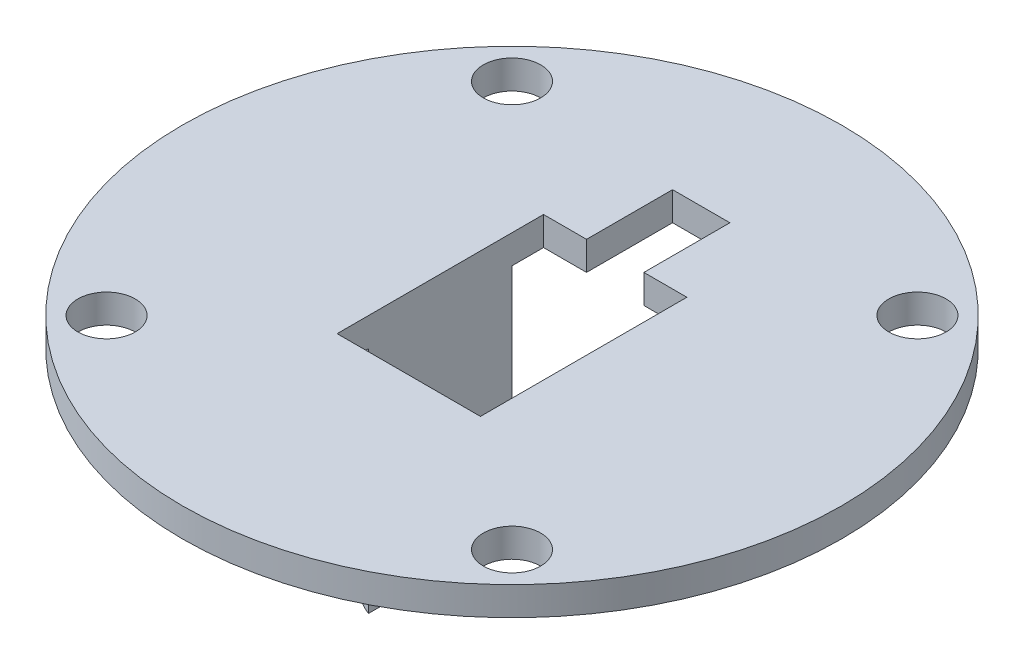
ISO-10303-21;
HEADER;
FILE_DESCRIPTION(('STEP AP214'),'2;1');
FILE_NAME('part.step','',(''),(''),'','','');
FILE_SCHEMA(('AUTOMOTIVE_DESIGN { 1 0 10303 214 1 1 1 1 }'));
ENDSEC;
DATA;
#1=APPLICATION_CONTEXT('core data for automotive mechanical design processes');
#2=APPLICATION_PROTOCOL_DEFINITION('international standard','automotive_design',2000,#1);
#3=PRODUCT_CONTEXT('',#1,'mechanical');
#4=PRODUCT('Part','Part','',(#3));
#5=PRODUCT_RELATED_PRODUCT_CATEGORY('part','',(#4));
#6=PRODUCT_DEFINITION_FORMATION('','',#4);
#7=PRODUCT_DEFINITION_CONTEXT('part definition',#1,'design');
#8=PRODUCT_DEFINITION('design','',#6,#7);
#9=PRODUCT_DEFINITION_SHAPE('','',#8);
#10=(LENGTH_UNIT() NAMED_UNIT(*) SI_UNIT(.MILLI.,.METRE.));
#11=(NAMED_UNIT(*) PLANE_ANGLE_UNIT() SI_UNIT($,.RADIAN.));
#12=(NAMED_UNIT(*) SI_UNIT($,.STERADIAN.) SOLID_ANGLE_UNIT());
#13=UNCERTAINTY_MEASURE_WITH_UNIT(LENGTH_MEASURE(1.E-05),#10,'distance_accuracy_value','');
#14=(GEOMETRIC_REPRESENTATION_CONTEXT(3) GLOBAL_UNCERTAINTY_ASSIGNED_CONTEXT((#13)) GLOBAL_UNIT_ASSIGNED_CONTEXT((#10,
#11,#12)) REPRESENTATION_CONTEXT('',''));
#15=CARTESIAN_POINT('',(0.,0.,0.));
#16=DIRECTION('',(0.,0.,1.));
#17=DIRECTION('',(1.,0.,0.));
#18=AXIS2_PLACEMENT_3D('',#15,#16,#17);
#19=CARTESIAN_POINT('',(-12.5,0.,-18.));
#20=DIRECTION('',(0.,0.,-1.));
#21=DIRECTION('',(-1.,0.,0.));
#22=AXIS2_PLACEMENT_3D('',#19,#20,#21);
#23=PLANE('',#22);
#24=DIRECTION('',(-1.,0.,0.));
#25=VECTOR('',#24,1.);
#26=CARTESIAN_POINT('',(-12.5,5.,-18.));
#27=LINE('',#26,#25);
#28=CARTESIAN_POINT('',(12.5,5.,-18.));
#29=VERTEX_POINT('',#28);
#30=CARTESIAN_POINT('',(5.,5.,-18.));
#31=VERTEX_POINT('',#30);
#32=EDGE_CURVE('E215',#29,#31,#27,.T.);
#33=ORIENTED_EDGE('',*,*,#32,.T.);
#34=DIRECTION('',(0.,-1.,0.));
#35=VECTOR('',#34,1.);
#36=CARTESIAN_POINT('',(5.,0.,-18.));
#37=LINE('',#36,#35);
#38=CARTESIAN_POINT('',(5.,0.,-18.));
#39=VERTEX_POINT('',#38);
#40=EDGE_CURVE('E11',#31,#39,#37,.T.);
#41=ORIENTED_EDGE('',*,*,#40,.T.);
#42=DIRECTION('',(-1.,0.,0.));
#43=VECTOR('',#42,1.);
#44=CARTESIAN_POINT('',(-12.5,0.,-18.));
#45=LINE('',#44,#43);
#46=CARTESIAN_POINT('',(12.5,0.,-18.));
#47=VERTEX_POINT('',#46);
#48=EDGE_CURVE('E199',#47,#39,#45,.T.);
#49=ORIENTED_EDGE('',*,*,#48,.F.);
#50=DIRECTION('',(0.,1.,0.));
#51=VECTOR('',#50,1.);
#52=CARTESIAN_POINT('',(12.5,0.,-18.));
#53=LINE('',#52,#51);
#54=EDGE_CURVE('E211',#47,#29,#53,.T.);
#55=ORIENTED_EDGE('',*,*,#54,.T.);
#56=EDGE_LOOP('',(#33,#41,#49,#55));
#57=FACE_BOUND('',#56,.T.);
#58=ADVANCED_FACE('F44',(#57),#23,.F.);
#59=CARTESIAN_POINT('',(0.,0.,0.));
#60=DIRECTION('',(0.,1.,0.));
#61=DIRECTION('',(0.,0.,1.));
#62=AXIS2_PLACEMENT_3D('',#59,#60,#61);
#63=PLANE('',#62);
#64=ORIENTED_EDGE('',*,*,#48,.T.);
#65=DIRECTION('',(0.,0.,-1.));
#66=VECTOR('',#65,1.);
#67=CARTESIAN_POINT('',(5.,0.,0.));
#68=LINE('',#67,#66);
#69=CARTESIAN_POINT('',(5.,0.,-33.));
#70=VERTEX_POINT('',#69);
#71=EDGE_CURVE('E170',#39,#70,#68,.T.);
#72=ORIENTED_EDGE('',*,*,#71,.T.);
#73=DIRECTION('',(-1.,0.,0.));
#74=VECTOR('',#73,1.);
#75=CARTESIAN_POINT('',(0.,0.,-33.));
#76=LINE('',#75,#74);
#77=CARTESIAN_POINT('',(-5.,0.,-33.));
#78=VERTEX_POINT('',#77);
#79=EDGE_CURVE('E142',#70,#78,#76,.T.);
#80=ORIENTED_EDGE('',*,*,#79,.T.);
#81=DIRECTION('',(0.,0.,1.));
#82=VECTOR('',#81,1.);
#83=CARTESIAN_POINT('',(-5.,0.,0.));
#84=LINE('',#83,#82);
#85=CARTESIAN_POINT('',(-5.,0.,-18.));
#86=VERTEX_POINT('',#85);
#87=EDGE_CURVE('E165',#78,#86,#84,.T.);
#88=ORIENTED_EDGE('',*,*,#87,.T.);
#89=CARTESIAN_POINT('',(-12.5,0.,-18.));
#90=VERTEX_POINT('',#89);
#91=EDGE_CURVE('E197',#86,#90,#45,.T.);
#92=ORIENTED_EDGE('',*,*,#91,.T.);
#93=DIRECTION('',(0.,0.,1.));
#94=VECTOR('',#93,1.);
#95=CARTESIAN_POINT('',(-12.5,0.,18.));
#96=LINE('',#95,#94);
#97=CARTESIAN_POINT('',(-12.5,0.,-12.5));
#98=VERTEX_POINT('',#97);
#99=EDGE_CURVE('E204',#90,#98,#96,.T.);
#100=ORIENTED_EDGE('',*,*,#99,.T.);
#101=CARTESIAN_POINT('',(-11.5,0.,-6.58392021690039));
#102=DIRECTION('',(0.,1.,0.));
#103=DIRECTION('',(0.,0.,1.));
#104=AXIS2_PLACEMENT_3D('',#101,#102,#103);
#105=CIRCLE('',#104,6.);
#106=CARTESIAN_POINT('',(-17.5,0.,-6.58392021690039));
#107=VERTEX_POINT('',#106);
#108=EDGE_CURVE('E286',#98,#107,#105,.T.);
#109=ORIENTED_EDGE('',*,*,#108,.T.);
#110=DIRECTION('',(0.,0.,-1.));
#111=VECTOR('',#110,1.);
#112=CARTESIAN_POINT('',(-17.5,0.,-12.5));
#113=LINE('',#112,#111);
#114=CARTESIAN_POINT('',(-17.5,0.,6.58392021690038));
#115=VERTEX_POINT('',#114);
#116=EDGE_CURVE('E181',#115,#107,#113,.T.);
#117=ORIENTED_EDGE('',*,*,#116,.F.);
#118=CARTESIAN_POINT('',(-11.5,0.,6.58392021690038));
#119=DIRECTION('',(0.,1.,0.));
#120=DIRECTION('',(0.,0.,1.));
#121=AXIS2_PLACEMENT_3D('',#118,#119,#120);
#122=CIRCLE('',#121,6.);
#123=CARTESIAN_POINT('',(-12.5,0.,12.5));
#124=VERTEX_POINT('',#123);
#125=EDGE_CURVE('E289',#115,#124,#122,.T.);
#126=ORIENTED_EDGE('',*,*,#125,.T.);
#127=CARTESIAN_POINT('',(-12.5,0.,18.));
#128=VERTEX_POINT('',#127);
#129=EDGE_CURVE('E203',#124,#128,#96,.T.);
#130=ORIENTED_EDGE('',*,*,#129,.T.);
#131=DIRECTION('',(1.,0.,0.));
#132=VECTOR('',#131,1.);
#133=CARTESIAN_POINT('',(-12.5,0.,18.));
#134=LINE('',#133,#132);
#135=CARTESIAN_POINT('',(12.5,0.,18.));
#136=VERTEX_POINT('',#135);
#137=EDGE_CURVE('E207',#128,#136,#134,.T.);
#138=ORIENTED_EDGE('',*,*,#137,.T.);
#139=DIRECTION('',(0.,0.,-1.));
#140=VECTOR('',#139,1.);
#141=CARTESIAN_POINT('',(12.5,0.,18.));
#142=LINE('',#141,#140);
#143=EDGE_CURVE('E193',#136,#47,#142,.T.);
#144=ORIENTED_EDGE('',*,*,#143,.T.);
#145=EDGE_LOOP('',(#64,#72,#80,#88,#92,#100,#109,#117,#126,#130,#138,#144));
#146=FACE_BOUND('',#145,.T.);
#147=CARTESIAN_POINT('',(0.,0.,0.));
#148=DIRECTION('',(0.,1.,0.));
#149=DIRECTION('',(0.,0.,1.));
#150=AXIS2_PLACEMENT_3D('',#147,#148,#149);
#151=CIRCLE('',#150,57.5);
#152=CARTESIAN_POINT('',(0.,0.,57.5));
#153=VERTEX_POINT('',#152);
#154=EDGE_CURVE('E267',#153,#153,#151,.T.);
#155=ORIENTED_EDGE('',*,*,#154,.F.);
#156=EDGE_LOOP('',(#155));
#157=FACE_BOUND('',#156,.T.);
#158=CARTESIAN_POINT('',(-35.3553390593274,0.,-35.3553390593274));
#159=DIRECTION('',(0.,1.,0.));
#160=DIRECTION('',(0.,0.,1.));
#161=AXIS2_PLACEMENT_3D('',#158,#159,#160);
#162=CIRCLE('',#161,5.);
#163=CARTESIAN_POINT('',(-35.3553390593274,0.,-30.3553390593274));
#164=VERTEX_POINT('',#163);
#165=EDGE_CURVE('E263',#164,#164,#162,.T.);
#166=ORIENTED_EDGE('',*,*,#165,.T.);
#167=EDGE_LOOP('',(#166));
#168=FACE_BOUND('',#167,.T.);
#169=CARTESIAN_POINT('',(35.3553390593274,0.,-35.3553390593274));
#170=DIRECTION('',(0.,1.,0.));
#171=DIRECTION('',(0.,0.,1.));
#172=AXIS2_PLACEMENT_3D('',#169,#170,#171);
#173=CIRCLE('',#172,5.);
#174=CARTESIAN_POINT('',(35.3553390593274,0.,-30.3553390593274));
#175=VERTEX_POINT('',#174);
#176=EDGE_CURVE('E244',#175,#175,#173,.T.);
#177=ORIENTED_EDGE('',*,*,#176,.T.);
#178=EDGE_LOOP('',(#177));
#179=FACE_BOUND('',#178,.T.);
#180=CARTESIAN_POINT('',(35.3553390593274,0.,35.3553390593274));
#181=DIRECTION('',(0.,1.,0.));
#182=DIRECTION('',(0.,0.,1.));
#183=AXIS2_PLACEMENT_3D('',#180,#181,#182);
#184=CIRCLE('',#183,5.);
#185=CARTESIAN_POINT('',(35.3553390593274,0.,40.3553390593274));
#186=VERTEX_POINT('',#185);
#187=EDGE_CURVE('E252',#186,#186,#184,.T.);
#188=ORIENTED_EDGE('',*,*,#187,.T.);
#189=EDGE_LOOP('',(#188));
#190=FACE_BOUND('',#189,.T.);
#191=CARTESIAN_POINT('',(-35.3553390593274,0.,35.3553390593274));
#192=DIRECTION('',(0.,1.,0.));
#193=DIRECTION('',(0.,0.,1.));
#194=AXIS2_PLACEMENT_3D('',#191,#192,#193);
#195=CIRCLE('',#194,5.);
#196=CARTESIAN_POINT('',(-35.3553390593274,0.,40.3553390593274));
#197=VERTEX_POINT('',#196);
#198=EDGE_CURVE('E228',#197,#197,#195,.T.);
#199=ORIENTED_EDGE('',*,*,#198,.T.);
#200=EDGE_LOOP('',(#199));
#201=FACE_BOUND('',#200,.T.);
#202=ADVANCED_FACE('F309',(#146,#157,#168,#179,#190,#201),#63,.F.);
#203=CARTESIAN_POINT('',(0.,5.,0.));
#204=DIRECTION('',(0.,-1.,0.));
#205=DIRECTION('',(0.,0.,-1.));
#206=AXIS2_PLACEMENT_3D('',#203,#204,#205);
#207=CYLINDRICAL_SURFACE('',#206,57.5);
#208=CARTESIAN_POINT('',(0.,5.,0.));
#209=DIRECTION('',(0.,1.,0.));
#210=DIRECTION('',(0.,0.,1.));
#211=AXIS2_PLACEMENT_3D('',#208,#209,#210);
#212=CIRCLE('',#211,57.5);
#213=CARTESIAN_POINT('',(0.,5.,57.5));
#214=VERTEX_POINT('',#213);
#215=EDGE_CURVE('E271',#214,#214,#212,.T.);
#216=ORIENTED_EDGE('',*,*,#215,.F.);
#217=EDGE_LOOP('',(#216));
#218=FACE_BOUND('',#217,.T.);
#219=ORIENTED_EDGE('',*,*,#154,.T.);
#220=EDGE_LOOP('',(#219));
#221=FACE_BOUND('',#220,.T.);
#222=ADVANCED_FACE('F330',(#218,#221),#207,.T.);
#223=CARTESIAN_POINT('',(0.,5.,0.));
#224=DIRECTION('',(0.,1.,0.));
#225=DIRECTION('',(0.,0.,1.));
#226=AXIS2_PLACEMENT_3D('',#223,#224,#225);
#227=PLANE('',#226);
#228=DIRECTION('',(0.,0.,-1.));
#229=VECTOR('',#228,1.);
#230=CARTESIAN_POINT('',(5.,5.,-18.));
#231=LINE('',#230,#229);
#232=CARTESIAN_POINT('',(5.,5.,-33.));
#233=VERTEX_POINT('',#232);
#234=EDGE_CURVE('E149',#31,#233,#231,.T.);
#235=ORIENTED_EDGE('',*,*,#234,.F.);
#236=ORIENTED_EDGE('',*,*,#32,.F.);
#237=DIRECTION('',(0.,0.,-1.));
#238=VECTOR('',#237,1.);
#239=CARTESIAN_POINT('',(12.5,5.,18.));
#240=LINE('',#239,#238);
#241=CARTESIAN_POINT('',(12.5,5.,18.));
#242=VERTEX_POINT('',#241);
#243=EDGE_CURVE('E192',#242,#29,#240,.T.);
#244=ORIENTED_EDGE('',*,*,#243,.F.);
#245=DIRECTION('',(1.,0.,0.));
#246=VECTOR('',#245,1.);
#247=CARTESIAN_POINT('',(-12.5,5.,18.));
#248=LINE('',#247,#246);
#249=CARTESIAN_POINT('',(-12.5,5.,18.));
#250=VERTEX_POINT('',#249);
#251=EDGE_CURVE('E198',#250,#242,#248,.T.);
#252=ORIENTED_EDGE('',*,*,#251,.F.);
#253=DIRECTION('',(0.,0.,1.));
#254=VECTOR('',#253,1.);
#255=CARTESIAN_POINT('',(-12.5,5.,18.));
#256=LINE('',#255,#254);
#257=CARTESIAN_POINT('',(-12.5,5.,-18.));
#258=VERTEX_POINT('',#257);
#259=EDGE_CURVE('E218',#258,#250,#256,.T.);
#260=ORIENTED_EDGE('',*,*,#259,.F.);
#261=CARTESIAN_POINT('',(-5.,5.,-18.));
#262=VERTEX_POINT('',#261);
#263=EDGE_CURVE('E214',#262,#258,#27,.T.);
#264=ORIENTED_EDGE('',*,*,#263,.F.);
#265=DIRECTION('',(0.,0.,1.));
#266=VECTOR('',#265,1.);
#267=CARTESIAN_POINT('',(-5.,5.,-18.));
#268=LINE('',#267,#266);
#269=CARTESIAN_POINT('',(-5.,5.,-33.));
#270=VERTEX_POINT('',#269);
#271=EDGE_CURVE('E60',#270,#262,#268,.T.);
#272=ORIENTED_EDGE('',*,*,#271,.F.);
#273=DIRECTION('',(-1.,0.,0.));
#274=VECTOR('',#273,1.);
#275=CARTESIAN_POINT('',(-5.,5.,-33.));
#276=LINE('',#275,#274);
#277=EDGE_CURVE('E140',#233,#270,#276,.T.);
#278=ORIENTED_EDGE('',*,*,#277,.F.);
#279=EDGE_LOOP('',(#235,#236,#244,#252,#260,#264,#272,#278));
#280=FACE_BOUND('',#279,.T.);
#281=CARTESIAN_POINT('',(-35.3553390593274,5.,35.3553390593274));
#282=DIRECTION('',(0.,1.,0.));
#283=DIRECTION('',(0.,0.,1.));
#284=AXIS2_PLACEMENT_3D('',#281,#282,#283);
#285=CIRCLE('',#284,5.);
#286=CARTESIAN_POINT('',(-35.3553390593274,5.,40.3553390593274));
#287=VERTEX_POINT('',#286);
#288=EDGE_CURVE('E256',#287,#287,#285,.T.);
#289=ORIENTED_EDGE('',*,*,#288,.F.);
#290=EDGE_LOOP('',(#289));
#291=FACE_BOUND('',#290,.T.);
#292=CARTESIAN_POINT('',(35.3553390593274,5.,35.3553390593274));
#293=DIRECTION('',(0.,1.,0.));
#294=DIRECTION('',(0.,0.,1.));
#295=AXIS2_PLACEMENT_3D('',#292,#293,#294);
#296=CIRCLE('',#295,5.);
#297=CARTESIAN_POINT('',(35.3553390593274,5.,40.3553390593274));
#298=VERTEX_POINT('',#297);
#299=EDGE_CURVE('E248',#298,#298,#296,.T.);
#300=ORIENTED_EDGE('',*,*,#299,.F.);
#301=EDGE_LOOP('',(#300));
#302=FACE_BOUND('',#301,.T.);
#303=CARTESIAN_POINT('',(35.3553390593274,5.,-35.3553390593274));
#304=DIRECTION('',(0.,1.,0.));
#305=DIRECTION('',(0.,0.,1.));
#306=AXIS2_PLACEMENT_3D('',#303,#304,#305);
#307=CIRCLE('',#306,5.);
#308=CARTESIAN_POINT('',(35.3553390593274,5.,-30.3553390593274));
#309=VERTEX_POINT('',#308);
#310=EDGE_CURVE('E239',#309,#309,#307,.T.);
#311=ORIENTED_EDGE('',*,*,#310,.F.);
#312=EDGE_LOOP('',(#311));
#313=FACE_BOUND('',#312,.T.);
#314=CARTESIAN_POINT('',(-35.3553390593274,5.,-35.3553390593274));
#315=DIRECTION('',(0.,1.,0.));
#316=DIRECTION('',(0.,0.,1.));
#317=AXIS2_PLACEMENT_3D('',#314,#315,#316);
#318=CIRCLE('',#317,5.);
#319=CARTESIAN_POINT('',(-35.3553390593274,5.,-30.3553390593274));
#320=VERTEX_POINT('',#319);
#321=EDGE_CURVE('E243',#320,#320,#318,.T.);
#322=ORIENTED_EDGE('',*,*,#321,.F.);
#323=EDGE_LOOP('',(#322));
#324=FACE_BOUND('',#323,.T.);
#325=ORIENTED_EDGE('',*,*,#215,.T.);
#326=EDGE_LOOP('',(#325));
#327=FACE_BOUND('',#326,.T.);
#328=ADVANCED_FACE('F156',(#280,#291,#302,#313,#324,#327),#227,.T.);
#329=CARTESIAN_POINT('',(-35.3553390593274,0.,-35.3553390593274));
#330=DIRECTION('',(0.,1.,0.));
#331=DIRECTION('',(0.,0.,1.));
#332=AXIS2_PLACEMENT_3D('',#329,#330,#331);
#333=CYLINDRICAL_SURFACE('',#332,5.);
#334=ORIENTED_EDGE('',*,*,#165,.F.);
#335=EDGE_LOOP('',(#334));
#336=FACE_BOUND('',#335,.T.);
#337=ORIENTED_EDGE('',*,*,#321,.T.);
#338=EDGE_LOOP('',(#337));
#339=FACE_BOUND('',#338,.T.);
#340=ADVANCED_FACE('F376',(#336,#339),#333,.F.);
#341=CARTESIAN_POINT('',(35.3553390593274,0.,-35.3553390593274));
#342=DIRECTION('',(0.,1.,0.));
#343=DIRECTION('',(0.,0.,1.));
#344=AXIS2_PLACEMENT_3D('',#341,#342,#343);
#345=CYLINDRICAL_SURFACE('',#344,5.);
#346=ORIENTED_EDGE('',*,*,#176,.F.);
#347=EDGE_LOOP('',(#346));
#348=FACE_BOUND('',#347,.T.);
#349=ORIENTED_EDGE('',*,*,#310,.T.);
#350=EDGE_LOOP('',(#349));
#351=FACE_BOUND('',#350,.T.);
#352=ADVANCED_FACE('F379',(#348,#351),#345,.F.);
#353=CARTESIAN_POINT('',(35.3553390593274,0.,35.3553390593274));
#354=DIRECTION('',(0.,1.,0.));
#355=DIRECTION('',(0.,0.,1.));
#356=AXIS2_PLACEMENT_3D('',#353,#354,#355);
#357=CYLINDRICAL_SURFACE('',#356,5.);
#358=ORIENTED_EDGE('',*,*,#187,.F.);
#359=EDGE_LOOP('',(#358));
#360=FACE_BOUND('',#359,.T.);
#361=ORIENTED_EDGE('',*,*,#299,.T.);
#362=EDGE_LOOP('',(#361));
#363=FACE_BOUND('',#362,.T.);
#364=ADVANCED_FACE('F384',(#360,#363),#357,.F.);
#365=CARTESIAN_POINT('',(-35.3553390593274,0.,35.3553390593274));
#366=DIRECTION('',(0.,1.,0.));
#367=DIRECTION('',(0.,0.,1.));
#368=AXIS2_PLACEMENT_3D('',#365,#366,#367);
#369=CYLINDRICAL_SURFACE('',#368,5.);
#370=ORIENTED_EDGE('',*,*,#198,.F.);
#371=EDGE_LOOP('',(#370));
#372=FACE_BOUND('',#371,.T.);
#373=ORIENTED_EDGE('',*,*,#288,.T.);
#374=EDGE_LOOP('',(#373));
#375=FACE_BOUND('',#374,.T.);
#376=ADVANCED_FACE('F381',(#372,#375),#369,.F.);
#377=CARTESIAN_POINT('',(12.5,0.,18.));
#378=DIRECTION('',(1.,0.,0.));
#379=DIRECTION('',(0.,0.,-1.));
#380=AXIS2_PLACEMENT_3D('',#377,#378,#379);
#381=PLANE('',#380);
#382=ORIENTED_EDGE('',*,*,#243,.T.);
#383=ORIENTED_EDGE('',*,*,#54,.F.);
#384=ORIENTED_EDGE('',*,*,#143,.F.);
#385=DIRECTION('',(0.,1.,0.));
#386=VECTOR('',#385,1.);
#387=CARTESIAN_POINT('',(12.5,0.,18.));
#388=LINE('',#387,#386);
#389=EDGE_CURVE('E225',#136,#242,#388,.T.);
#390=ORIENTED_EDGE('',*,*,#389,.T.);
#391=EDGE_LOOP('',(#382,#383,#384,#390));
#392=FACE_BOUND('',#391,.T.);
#393=ADVANCED_FACE('F321',(#392),#381,.F.);
#394=CARTESIAN_POINT('',(-12.5,0.,18.));
#395=DIRECTION('',(0.,0.,1.));
#396=DIRECTION('',(1.,0.,0.));
#397=AXIS2_PLACEMENT_3D('',#394,#395,#396);
#398=PLANE('',#397);
#399=ORIENTED_EDGE('',*,*,#251,.T.);
#400=ORIENTED_EDGE('',*,*,#389,.F.);
#401=ORIENTED_EDGE('',*,*,#137,.F.);
#402=DIRECTION('',(0.,1.,0.));
#403=VECTOR('',#402,1.);
#404=CARTESIAN_POINT('',(-12.5,0.,18.));
#405=LINE('',#404,#403);
#406=EDGE_CURVE('E229',#128,#250,#405,.T.);
#407=ORIENTED_EDGE('',*,*,#406,.T.);
#408=EDGE_LOOP('',(#399,#400,#401,#407));
#409=FACE_BOUND('',#408,.T.);
#410=ADVANCED_FACE('F317',(#409),#398,.F.);
#411=CARTESIAN_POINT('',(-12.5,0.,18.));
#412=DIRECTION('',(-1.,0.,0.));
#413=DIRECTION('',(0.,0.,1.));
#414=AXIS2_PLACEMENT_3D('',#411,#412,#413);
#415=PLANE('',#414);
#416=ORIENTED_EDGE('',*,*,#259,.T.);
#417=ORIENTED_EDGE('',*,*,#406,.F.);
#418=ORIENTED_EDGE('',*,*,#129,.F.);
#419=DIRECTION('',(0.,1.,0.));
#420=VECTOR('',#419,1.);
#421=CARTESIAN_POINT('',(-12.5,-40.,12.5));
#422=LINE('',#421,#420);
#423=CARTESIAN_POINT('',(-12.5,-40.,12.5));
#424=VERTEX_POINT('',#423);
#425=EDGE_CURVE('E188',#424,#124,#422,.T.);
#426=ORIENTED_EDGE('',*,*,#425,.F.);
#427=DIRECTION('',(0.,0.,1.));
#428=VECTOR('',#427,1.);
#429=CARTESIAN_POINT('',(-12.5,-40.,-12.5));
#430=LINE('',#429,#428);
#431=CARTESIAN_POINT('',(-12.5,-40.,-12.5));
#432=VERTEX_POINT('',#431);
#433=EDGE_CURVE('E176',#432,#424,#430,.T.);
#434=ORIENTED_EDGE('',*,*,#433,.F.);
#435=DIRECTION('',(0.,1.,0.));
#436=VECTOR('',#435,1.);
#437=CARTESIAN_POINT('',(-12.5,-40.,-12.5));
#438=LINE('',#437,#436);
#439=EDGE_CURVE('E180',#432,#98,#438,.T.);
#440=ORIENTED_EDGE('',*,*,#439,.T.);
#441=ORIENTED_EDGE('',*,*,#99,.F.);
#442=DIRECTION('',(0.,1.,0.));
#443=VECTOR('',#442,1.);
#444=CARTESIAN_POINT('',(-12.5,0.,-18.));
#445=LINE('',#444,#443);
#446=EDGE_CURVE('E232',#90,#258,#445,.T.);
#447=ORIENTED_EDGE('',*,*,#446,.T.);
#448=EDGE_LOOP('',(#416,#417,#418,#426,#434,#440,#441,#447));
#449=FACE_BOUND('',#448,.T.);
#450=ADVANCED_FACE('F315',(#449),#415,.F.);
#451=ORIENTED_EDGE('',*,*,#91,.F.);
#452=DIRECTION('',(0.,1.,0.));
#453=VECTOR('',#452,1.);
#454=CARTESIAN_POINT('',(-5.,0.,-18.));
#455=LINE('',#454,#453);
#456=EDGE_CURVE('E53',#86,#262,#455,.T.);
#457=ORIENTED_EDGE('',*,*,#456,.T.);
#458=ORIENTED_EDGE('',*,*,#263,.T.);
#459=ORIENTED_EDGE('',*,*,#446,.F.);
#460=EDGE_LOOP('',(#451,#457,#458,#459));
#461=FACE_BOUND('',#460,.T.);
#462=ADVANCED_FACE('F299',(#461),#23,.F.);
#463=CARTESIAN_POINT('',(-17.5,-40.,-12.5));
#464=DIRECTION('',(1.,0.,0.));
#465=DIRECTION('',(0.,0.,-1.));
#466=AXIS2_PLACEMENT_3D('',#463,#464,#465);
#467=PLANE('',#466);
#468=ORIENTED_EDGE('',*,*,#116,.T.);
#469=DIRECTION('',(0.,-1.,0.));
#470=VECTOR('',#469,1.);
#471=CARTESIAN_POINT('',(-17.5,-40.,-6.58392021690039));
#472=LINE('',#471,#470);
#473=CARTESIAN_POINT('',(-17.5,-34.0839202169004,-6.58392021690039));
#474=VERTEX_POINT('',#473);
#475=EDGE_CURVE('E68',#107,#474,#472,.T.);
#476=ORIENTED_EDGE('',*,*,#475,.T.);
#477=DIRECTION('',(0.,0.,1.));
#478=VECTOR('',#477,1.);
#479=CARTESIAN_POINT('',(-17.5,-34.0839202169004,-12.5));
#480=LINE('',#479,#478);
#481=CARTESIAN_POINT('',(-17.5,-34.0839202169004,6.58392021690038));
#482=VERTEX_POINT('',#481);
#483=EDGE_CURVE('E281',#474,#482,#480,.T.);
#484=ORIENTED_EDGE('',*,*,#483,.T.);
#485=DIRECTION('',(0.,1.,0.));
#486=VECTOR('',#485,1.);
#487=CARTESIAN_POINT('',(-17.5,-40.,6.58392021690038));
#488=LINE('',#487,#486);
#489=EDGE_CURVE('E275',#482,#115,#488,.T.);
#490=ORIENTED_EDGE('',*,*,#489,.T.);
#491=EDGE_LOOP('',(#468,#476,#484,#490));
#492=FACE_BOUND('',#491,.T.);
#493=ADVANCED_FACE('F335',(#492),#467,.F.);
#494=CARTESIAN_POINT('',(-11.5,-40.,6.58392021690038));
#495=DIRECTION('',(0.,1.,0.));
#496=DIRECTION('',(0.,0.,1.));
#497=AXIS2_PLACEMENT_3D('',#494,#495,#496);
#498=CYLINDRICAL_SURFACE('',#497,6.);
#499=ORIENTED_EDGE('',*,*,#125,.F.);
#500=ORIENTED_EDGE('',*,*,#489,.F.);
#501=CARTESIAN_POINT('',(-11.5,-34.0839202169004,6.58392021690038));
#502=DIRECTION('',(0.,0.707106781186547,0.707106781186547));
#503=DIRECTION('',(0.,0.707106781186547,-0.707106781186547));
#504=AXIS2_PLACEMENT_3D('',#501,#502,#503);
#505=ELLIPSE('',#504,8.48528137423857,6.);
#506=EDGE_CURVE('E184',#424,#482,#505,.F.);
#507=ORIENTED_EDGE('',*,*,#506,.F.);
#508=ORIENTED_EDGE('',*,*,#425,.T.);
#509=EDGE_LOOP('',(#499,#500,#507,#508));
#510=FACE_BOUND('',#509,.T.);
#511=ADVANCED_FACE('F46',(#510),#498,.T.);
#512=CARTESIAN_POINT('',(-11.5,-40.,-6.58392021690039));
#513=DIRECTION('',(0.,-1.,0.));
#514=DIRECTION('',(0.,0.,-1.));
#515=AXIS2_PLACEMENT_3D('',#512,#513,#514);
#516=CYLINDRICAL_SURFACE('',#515,6.);
#517=ORIENTED_EDGE('',*,*,#108,.F.);
#518=ORIENTED_EDGE('',*,*,#439,.F.);
#519=CARTESIAN_POINT('',(-11.5,-34.0839202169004,-6.58392021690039));
#520=DIRECTION('',(0.,-0.707106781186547,0.707106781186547));
#521=DIRECTION('',(0.,-0.707106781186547,-0.707106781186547));
#522=AXIS2_PLACEMENT_3D('',#519,#520,#521);
#523=ELLIPSE('',#522,8.48528137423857,6.);
#524=EDGE_CURVE('E175',#474,#432,#523,.T.);
#525=ORIENTED_EDGE('',*,*,#524,.F.);
#526=ORIENTED_EDGE('',*,*,#475,.F.);
#527=EDGE_LOOP('',(#517,#518,#525,#526));
#528=FACE_BOUND('',#527,.T.);
#529=ADVANCED_FACE('F362',(#528),#516,.T.);
#530=CARTESIAN_POINT('',(-11.5,-34.0839202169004,0.));
#531=DIRECTION('',(0.,0.,1.));
#532=DIRECTION('',(1.,0.,0.));
#533=AXIS2_PLACEMENT_3D('',#530,#531,#532);
#534=CYLINDRICAL_SURFACE('',#533,6.);
#535=ORIENTED_EDGE('',*,*,#506,.T.);
#536=ORIENTED_EDGE('',*,*,#483,.F.);
#537=ORIENTED_EDGE('',*,*,#524,.T.);
#538=ORIENTED_EDGE('',*,*,#433,.T.);
#539=EDGE_LOOP('',(#535,#536,#537,#538));
#540=FACE_BOUND('',#539,.T.);
#541=ADVANCED_FACE('F352',(#540),#534,.T.);
#542=CARTESIAN_POINT('',(-5.,-40.,-33.));
#543=DIRECTION('',(0.,0.,-1.));
#544=DIRECTION('',(-1.,0.,0.));
#545=AXIS2_PLACEMENT_3D('',#542,#543,#544);
#546=PLANE('',#545);
#547=DIRECTION('',(0.,1.,0.));
#548=VECTOR('',#547,1.);
#549=CARTESIAN_POINT('',(5.,-40.,-33.));
#550=LINE('',#549,#548);
#551=EDGE_CURVE('E135',#70,#233,#550,.T.);
#552=ORIENTED_EDGE('',*,*,#551,.T.);
#553=ORIENTED_EDGE('',*,*,#277,.T.);
#554=DIRECTION('',(0.,1.,0.));
#555=VECTOR('',#554,1.);
#556=CARTESIAN_POINT('',(-5.,-40.,-33.));
#557=LINE('',#556,#555);
#558=EDGE_CURVE('E146',#78,#270,#557,.T.);
#559=ORIENTED_EDGE('',*,*,#558,.F.);
#560=ORIENTED_EDGE('',*,*,#79,.F.);
#561=EDGE_LOOP('',(#552,#553,#559,#560));
#562=FACE_BOUND('',#561,.T.);
#563=ADVANCED_FACE('F137',(#562),#546,.F.);
#564=CARTESIAN_POINT('',(5.,-40.,-18.));
#565=DIRECTION('',(1.,0.,0.));
#566=DIRECTION('',(0.,0.,-1.));
#567=AXIS2_PLACEMENT_3D('',#564,#565,#566);
#568=PLANE('',#567);
#569=ORIENTED_EDGE('',*,*,#40,.F.);
#570=ORIENTED_EDGE('',*,*,#234,.T.);
#571=ORIENTED_EDGE('',*,*,#551,.F.);
#572=ORIENTED_EDGE('',*,*,#71,.F.);
#573=EDGE_LOOP('',(#569,#570,#571,#572));
#574=FACE_BOUND('',#573,.T.);
#575=ADVANCED_FACE('F150',(#574),#568,.F.);
#576=CARTESIAN_POINT('',(-5.,-40.,-18.));
#577=DIRECTION('',(-1.,0.,0.));
#578=DIRECTION('',(0.,0.,1.));
#579=AXIS2_PLACEMENT_3D('',#576,#577,#578);
#580=PLANE('',#579);
#581=ORIENTED_EDGE('',*,*,#558,.T.);
#582=ORIENTED_EDGE('',*,*,#271,.T.);
#583=ORIENTED_EDGE('',*,*,#456,.F.);
#584=ORIENTED_EDGE('',*,*,#87,.F.);
#585=EDGE_LOOP('',(#581,#582,#583,#584));
#586=FACE_BOUND('',#585,.T.);
#587=ADVANCED_FACE('F350',(#586),#580,.F.);
#588=CLOSED_SHELL('',(#58,#202,#222,#328,#340,#352,#364,#376,#393,#410,#450,#462,#493,#511,#529,
#541,#563,#575,#587));
#589=MANIFOLD_SOLID_BREP('B2',#588);
#590=ADVANCED_BREP_SHAPE_REPRESENTATION('',(#18,#589),#14);
#591=SHAPE_DEFINITION_REPRESENTATION(#9,#590);
ENDSEC;
END-ISO-10303-21;
